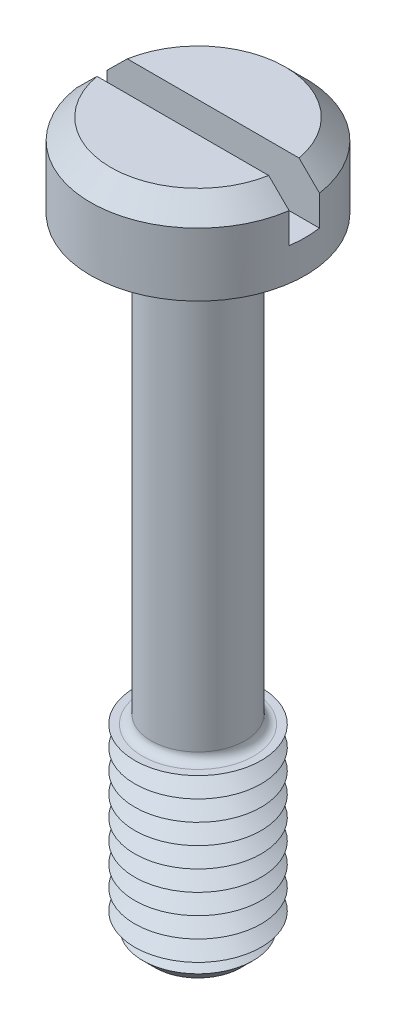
ISO-10303-21;
HEADER;
FILE_DESCRIPTION(('STEP AP214'),'2;1');
FILE_NAME('part.step','',(''),(''),'','','');
FILE_SCHEMA(('AUTOMOTIVE_DESIGN { 1 0 10303 214 1 1 1 1 }'));
ENDSEC;
DATA;
#1=APPLICATION_CONTEXT('core data for automotive mechanical design processes');
#2=APPLICATION_PROTOCOL_DEFINITION('international standard','automotive_design',2000,#1);
#3=PRODUCT_CONTEXT('',#1,'mechanical');
#4=PRODUCT('Part','Part','',(#3));
#5=PRODUCT_RELATED_PRODUCT_CATEGORY('part','',(#4));
#6=PRODUCT_DEFINITION_FORMATION('','',#4);
#7=PRODUCT_DEFINITION_CONTEXT('part definition',#1,'design');
#8=PRODUCT_DEFINITION('design','',#6,#7);
#9=PRODUCT_DEFINITION_SHAPE('','',#8);
#10=(LENGTH_UNIT() NAMED_UNIT(*) SI_UNIT(.MILLI.,.METRE.));
#11=(NAMED_UNIT(*) PLANE_ANGLE_UNIT() SI_UNIT($,.RADIAN.));
#12=(NAMED_UNIT(*) SI_UNIT($,.STERADIAN.) SOLID_ANGLE_UNIT());
#13=UNCERTAINTY_MEASURE_WITH_UNIT(LENGTH_MEASURE(1.E-05),#10,'distance_accuracy_value','');
#14=(GEOMETRIC_REPRESENTATION_CONTEXT(3) GLOBAL_UNCERTAINTY_ASSIGNED_CONTEXT((#13)) GLOBAL_UNIT_ASSIGNED_CONTEXT((#10,
#11,#12)) REPRESENTATION_CONTEXT('',''));
#15=CARTESIAN_POINT('',(0.,0.,0.));
#16=DIRECTION('',(0.,0.,1.));
#17=DIRECTION('',(1.,0.,0.));
#18=AXIS2_PLACEMENT_3D('',#15,#16,#17);
#19=CARTESIAN_POINT('',(0.,3.3,0.));
#20=DIRECTION('',(0.,1.,0.));
#21=DIRECTION('',(0.,0.,1.));
#22=AXIS2_PLACEMENT_3D('',#19,#20,#21);
#23=PLANE('',#22);
#24=DIRECTION('',(-1.,0.,0.));
#25=VECTOR('',#24,1.);
#26=CARTESIAN_POINT('',(4.25,3.3,-0.6));
#27=LINE('',#26,#25);
#28=CARTESIAN_POINT('',(3.39742549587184,3.3,-0.6));
#29=VERTEX_POINT('',#28);
#30=CARTESIAN_POINT('',(-3.39742549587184,3.3,-0.6));
#31=VERTEX_POINT('',#30);
#32=EDGE_CURVE('E110',#29,#31,#27,.T.);
#33=ORIENTED_EDGE('',*,*,#32,.F.);
#34=CARTESIAN_POINT('',(0.,3.3,0.));
#35=DIRECTION('',(0.,1.,0.));
#36=DIRECTION('',(0.,0.,1.));
#37=AXIS2_PLACEMENT_3D('',#34,#35,#36);
#38=CIRCLE('',#37,3.45000000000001);
#39=EDGE_CURVE('E113',#29,#31,#38,.T.);
#40=ORIENTED_EDGE('',*,*,#39,.T.);
#41=EDGE_LOOP('',(#33,#40));
#42=FACE_BOUND('',#41,.T.);
#43=ADVANCED_FACE('F39',(#42),#23,.T.);
#44=CARTESIAN_POINT('',(0.,3.3,0.));
#45=DIRECTION('',(0.,-1.,0.));
#46=DIRECTION('',(0.,0.,-1.));
#47=AXIS2_PLACEMENT_3D('',#44,#45,#46);
#48=CONICAL_SURFACE('',#47,3.45000000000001,0.785398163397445);
#49=CARTESIAN_POINT('',(9.35351408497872,-2.62273843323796,-0.6));
#50=CARTESIAN_POINT('',(9.03263557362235,-2.30252317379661,-0.6));
#51=CARTESIAN_POINT('',(8.71172811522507,-1.98233690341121,-0.6));
#52=CARTESIAN_POINT('',(8.06981262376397,-1.34205341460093,-0.6));
#53=CARTESIAN_POINT('',(7.74880458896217,-1.02195619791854,-0.6));
#54=CARTESIAN_POINT('',(7.10652460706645,-0.381761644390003,-0.6));
#55=CARTESIAN_POINT('',(6.7852526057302,-0.0616643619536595,-0.6));
#56=CARTESIAN_POINT('',(6.14251393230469,0.578323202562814,-0.6));
#57=CARTESIAN_POINT('',(5.82104726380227,0.898213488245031,-0.6));
#58=CARTESIAN_POINT('',(5.1719620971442,1.54347500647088,-0.6));
#59=CARTESIAN_POINT('',(4.84433778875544,1.86884039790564,-0.6));
#60=CARTESIAN_POINT('',(4.35244442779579,2.35644593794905,-0.6));
#61=CARTESIAN_POINT('',(4.18839924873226,2.51891187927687,-0.6));
#62=CARTESIAN_POINT('',(3.86009606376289,2.84362679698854,-0.6));
#63=CARTESIAN_POINT('',(3.69583805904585,3.00587577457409,-0.6));
#64=CARTESIAN_POINT('',(3.36705354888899,3.33001661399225,-0.6));
#65=CARTESIAN_POINT('',(3.20252712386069,3.49190855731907,-0.6));
#66=CARTESIAN_POINT('',(2.87298689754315,3.81520272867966,-0.6));
#67=CARTESIAN_POINT('',(2.70797308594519,3.97660494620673,-0.6));
#68=CARTESIAN_POINT('',(2.37716903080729,4.29858210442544,-0.6));
#69=CARTESIAN_POINT('',(2.21137886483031,4.45915712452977,-0.6));
#70=CARTESIAN_POINT('',(1.96157219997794,4.69884609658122,-0.6));
#71=CARTESIAN_POINT('',(1.87811785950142,4.77854546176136,-0.6));
#72=CARTESIAN_POINT('',(1.71066064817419,4.93736532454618,-0.6));
#73=CARTESIAN_POINT('',(1.62665778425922,5.01648582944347,-0.6));
#74=CARTESIAN_POINT('',(1.49655488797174,5.13773269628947,-0.6));
#75=CARTESIAN_POINT('',(1.45074972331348,5.18017521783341,-0.6));
#76=CARTESIAN_POINT('',(1.35882119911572,5.26471614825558,-0.6));
#77=CARTESIAN_POINT('',(1.31269783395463,5.30681455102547,-0.6));
#78=CARTESIAN_POINT('',(1.22008852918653,5.39050695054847,-0.6));
#79=CARTESIAN_POINT('',(1.17360305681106,5.43210146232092,-0.6));
#80=CARTESIAN_POINT('',(1.08007401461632,5.51465347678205,-0.6));
#81=CARTESIAN_POINT('',(1.03303046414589,5.55561100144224,-0.6));
#82=CARTESIAN_POINT('',(0.919047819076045,5.65299331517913,-0.6));
#83=CARTESIAN_POINT('',(0.85173842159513,5.70899242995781,-0.6));
#84=CARTESIAN_POINT('',(0.748806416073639,5.79068526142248,-0.6));
#85=CARTESIAN_POINT('',(0.714125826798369,5.81756213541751,-0.6));
#86=CARTESIAN_POINT('',(0.643915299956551,5.87018079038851,-0.6));
#87=CARTESIAN_POINT('',(0.608385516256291,5.89592277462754,-0.6));
#88=CARTESIAN_POINT('',(0.545162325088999,5.93955652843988,-0.6));
#89=CARTESIAN_POINT('',(0.517718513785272,5.95780799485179,-0.6));
#90=CARTESIAN_POINT('',(0.462025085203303,5.9930317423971,-0.6));
#91=CARTESIAN_POINT('',(0.43377569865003,6.01000438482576,-0.6));
#92=CARTESIAN_POINT('',(0.376341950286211,6.04213837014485,-0.6));
#93=CARTESIAN_POINT('',(0.347160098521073,6.05730412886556,-0.6));
#94=CARTESIAN_POINT('',(0.287642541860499,6.08513394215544,-0.6));
#95=CARTESIAN_POINT('',(0.257308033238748,6.09780051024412,-0.6));
#96=CARTESIAN_POINT('',(0.190863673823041,6.12124627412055,-0.6));
#97=CARTESIAN_POINT('',(0.154554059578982,6.13148571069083,-0.6));
#98=CARTESIAN_POINT('',(0.0807909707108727,6.14565404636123,-0.6));
#99=CARTESIAN_POINT('',(0.0433423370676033,6.14960664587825,-0.6));
#100=CARTESIAN_POINT('',(-0.0317987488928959,6.15033783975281,-0.6));
#101=CARTESIAN_POINT('',(-0.0694915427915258,6.14708428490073,-0.6));
#102=CARTESIAN_POINT('',(-0.143790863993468,6.13410921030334,-0.6));
#103=CARTESIAN_POINT('',(-0.180393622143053,6.12436747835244,-0.6));
#104=CARTESIAN_POINT('',(-0.254098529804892,6.09939647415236,-0.6));
#105=CARTESIAN_POINT('',(-0.291094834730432,6.08386859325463,-0.6));
#106=CARTESIAN_POINT('',(-0.36340802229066,6.04924663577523,-0.6));
#107=CARTESIAN_POINT('',(-0.398721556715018,6.03014579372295,-0.6));
#108=CARTESIAN_POINT('',(-0.468234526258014,5.98944452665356,-0.6));
#109=CARTESIAN_POINT('',(-0.502422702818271,5.96782521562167,-0.6));
#110=CARTESIAN_POINT('',(-0.569689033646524,5.9230061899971,-0.6));
#111=CARTESIAN_POINT('',(-0.602768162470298,5.89980792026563,-0.6));
#112=CARTESIAN_POINT('',(-0.671148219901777,5.85008963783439,-0.6));
#113=CARTESIAN_POINT('',(-0.706369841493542,5.82346130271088,-0.6));
#114=CARTESIAN_POINT('',(-0.776087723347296,5.76926828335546,-0.6));
#115=CARTESIAN_POINT('',(-0.810583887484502,5.74170347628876,-0.6));
#116=CARTESIAN_POINT('',(-0.913286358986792,5.65798278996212,-0.6));
#117=CARTESIAN_POINT('',(-0.980673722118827,5.60082541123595,-0.6));
#118=CARTESIAN_POINT('',(-1.11424616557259,5.48490670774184,-0.6));
#119=CARTESIAN_POINT('',(-1.18042891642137,5.42614273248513,-0.6));
#120=CARTESIAN_POINT('',(-1.31191262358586,5.30767463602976,-0.6));
#121=CARTESIAN_POINT('',(-1.37721382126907,5.24797078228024,-0.6));
#122=CARTESIAN_POINT('',(-1.50701089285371,5.12812906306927,-0.6));
#123=CARTESIAN_POINT('',(-1.57150872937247,5.06799331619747,-0.6));
#124=CARTESIAN_POINT('',(-1.70009132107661,4.94727328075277,-0.6));
#125=CARTESIAN_POINT('',(-1.76417604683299,4.88668896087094,-0.6));
#126=CARTESIAN_POINT('',(-1.95584105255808,4.70458824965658,-0.6));
#127=CARTESIAN_POINT('',(-2.08296922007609,4.5825964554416,-0.6));
#128=CARTESIAN_POINT('',(-2.33599178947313,4.33840625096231,-0.6));
#129=CARTESIAN_POINT('',(-2.46188913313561,4.21621087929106,-0.6));
#130=CARTESIAN_POINT('',(-2.71323511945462,3.97135925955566,-0.6));
#131=CARTESIAN_POINT('',(-2.83868376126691,3.84870301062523,-0.6));
#132=CARTESIAN_POINT('',(-3.21459106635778,3.48027743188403,-0.6));
#133=CARTESIAN_POINT('',(-3.4646062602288,3.23405597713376,-0.6));
#134=CARTESIAN_POINT('',(-3.96413793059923,2.74090313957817,-0.6));
#135=CARTESIAN_POINT('',(-4.21365415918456,2.49397150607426,-0.6));
#136=CARTESIAN_POINT('',(-4.71232475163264,1.99974737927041,-0.6));
#137=CARTESIAN_POINT('',(-4.96147911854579,1.75245488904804,-0.6));
#138=CARTESIAN_POINT('',(-5.45958725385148,1.2576154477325,-0.6));
#139=CARTESIAN_POINT('',(-5.70854099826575,1.01006847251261,-0.6));
#140=CARTESIAN_POINT('',(-6.20629498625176,0.514819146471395,-0.6));
#141=CARTESIAN_POINT('',(-6.45509522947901,0.267116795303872,-0.6));
#142=CARTESIAN_POINT('',(-7.20128563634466,-0.476100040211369,-0.6));
#143=CARTESIAN_POINT('',(-7.69851620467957,-0.971774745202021,-0.6));
#144=CARTESIAN_POINT('',(-8.38865115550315,-1.66007026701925,-0.6));
#145=CARTESIAN_POINT('',(-8.58165346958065,-1.85259293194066,-0.6));
#146=CARTESIAN_POINT('',(-8.87112736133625,-2.14139225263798,-0.6));
#147=CARTESIAN_POINT('',(-8.96761014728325,-2.23765767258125,-0.6));
#148=CARTESIAN_POINT('',(-9.16056764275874,-2.4301938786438,-0.6));
#149=CARTESIAN_POINT('',(-9.25704235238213,-2.52646466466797,-0.6));
#150=CARTESIAN_POINT('',(-9.35351408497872,-2.62273843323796,-0.6));
#151=B_SPLINE_CURVE_WITH_KNOTS('',3,(#49,#50,#51,#52,#53,#54,#55,#56,#57,#58,#59,#60,#61,#62,
#63,#64,#65,#66,#67,#68,#69,#70,#71,#72,#73,#74,#75,#76,#77,#78,#79,#80,#81,#82,#83,#84,#85,#86,
#87,#88,#89,#90,#91,#92,#93,#94,#95,#96,#97,#98,#99,#100,#101,#102,#103,#104,#105,#106,#107,
#108,#109,#110,#111,#112,#113,#114,#115,#116,#117,#118,#119,#120,#121,#122,#123,#124,#125,#126,
#127,#128,#129,#130,#131,#132,#133,#134,#135,#136,#137,#138,#139,#140,#141,#142,#143,#144,#145,
#146,#147,#148,#149,#150),.UNSPECIFIED.,.F.,.F.,(4,2,2,2,2,2,2,2,2,2,2,2,2,2,2,2,2,2,2,2,2,2,2,
2,2,2,2,2,2,2,2,2,2,2,2,2,2,2,2,2,2,2,2,2,2,2,2,2,2,2,4),(0.,1.35996600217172,2.71995696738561,
4.08050889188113,5.44103646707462,6.82624457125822,7.51888721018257,8.2115259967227,
8.90398568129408,9.59646011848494,10.288866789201,10.635058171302,10.9812451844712,
11.1685812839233,11.3559207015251,11.5430489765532,11.7301707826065,11.9927784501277,
12.1243921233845,12.2559821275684,12.3548333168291,12.4536564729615,12.5522329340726,
12.6507097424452,12.763461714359,12.8757876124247,12.9886156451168,13.101796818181,
13.2218851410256,13.3422031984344,13.4634899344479,13.584667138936,13.7171086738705,
13.8495676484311,14.1146090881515,14.3801178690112,14.6455524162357,14.910099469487,
15.17466516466,15.703234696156,16.2295761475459,16.7559185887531,17.8086237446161,
18.8617626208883,19.9148925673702,20.9681337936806,22.0213773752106,24.1276499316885,
24.9454725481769,25.354353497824,25.7632286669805),.UNSPECIFIED.);
#152=CARTESIAN_POINT('',(4.20743389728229,2.5,-0.6));
#153=VERTEX_POINT('',#152);
#154=EDGE_CURVE('E267',#153,#29,#151,.T.);
#155=ORIENTED_EDGE('',*,*,#154,.F.);
#156=CARTESIAN_POINT('',(0.,2.5,0.));
#157=DIRECTION('',(0.,1.,0.));
#158=DIRECTION('',(0.,0.,1.));
#159=AXIS2_PLACEMENT_3D('',#156,#157,#158);
#160=CIRCLE('',#159,4.25);
#161=CARTESIAN_POINT('',(-4.20743389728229,2.5,-0.6));
#162=VERTEX_POINT('',#161);
#163=EDGE_CURVE('E127',#162,#153,#160,.F.);
#164=ORIENTED_EDGE('',*,*,#163,.F.);
#165=EDGE_CURVE('E102',#31,#162,#151,.T.);
#166=ORIENTED_EDGE('',*,*,#165,.F.);
#167=ORIENTED_EDGE('',*,*,#39,.F.);
#168=EDGE_LOOP('',(#155,#164,#166,#167));
#169=FACE_BOUND('',#168,.T.);
#170=ADVANCED_FACE('F229',(#169),#48,.T.);
#171=CARTESIAN_POINT('',(0.,-25.,0.));
#172=DIRECTION('',(0.,1.,0.));
#173=DIRECTION('',(0.,0.,1.));
#174=AXIS2_PLACEMENT_3D('',#171,#172,#173);
#175=CYLINDRICAL_SURFACE('',#174,1.85);
#176=CARTESIAN_POINT('',(0.,-17.15,0.));
#177=DIRECTION('',(0.,-1.,0.));
#178=DIRECTION('',(0.,0.,-1.));
#179=AXIS2_PLACEMENT_3D('',#176,#177,#178);
#180=CIRCLE('',#179,1.85);
#181=CARTESIAN_POINT('',(0.,-17.15,-1.85));
#182=VERTEX_POINT('',#181);
#183=EDGE_CURVE('E122',#182,#182,#180,.F.);
#184=ORIENTED_EDGE('',*,*,#183,.T.);
#185=EDGE_LOOP('',(#184));
#186=FACE_BOUND('',#185,.T.);
#187=CARTESIAN_POINT('',(0.,-0.35,0.));
#188=DIRECTION('',(0.,1.,0.));
#189=DIRECTION('',(0.,0.,1.));
#190=AXIS2_PLACEMENT_3D('',#187,#188,#189);
#191=CIRCLE('',#190,1.85);
#192=CARTESIAN_POINT('',(0.,-0.35,1.85));
#193=VERTEX_POINT('',#192);
#194=EDGE_CURVE('E382',#193,#193,#191,.F.);
#195=ORIENTED_EDGE('',*,*,#194,.T.);
#196=EDGE_LOOP('',(#195));
#197=FACE_BOUND('',#196,.T.);
#198=ADVANCED_FACE('F225',(#186,#197),#175,.T.);
#199=CARTESIAN_POINT('',(0.,3.3,0.));
#200=DIRECTION('',(0.,-1.,0.));
#201=DIRECTION('',(0.,0.,-1.));
#202=AXIS2_PLACEMENT_3D('',#199,#200,#201);
#203=CYLINDRICAL_SURFACE('',#202,4.25);
#204=ORIENTED_EDGE('',*,*,#163,.T.);
#205=DIRECTION('',(0.,-1.,0.));
#206=VECTOR('',#205,1.);
#207=CARTESIAN_POINT('',(4.20743389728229,3.3,-0.6));
#208=LINE('',#207,#206);
#209=CARTESIAN_POINT('',(4.20743389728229,1.3,-0.6));
#210=VERTEX_POINT('',#209);
#211=EDGE_CURVE('E64',#153,#210,#208,.T.);
#212=ORIENTED_EDGE('',*,*,#211,.T.);
#213=CARTESIAN_POINT('',(0.,1.3,0.));
#214=DIRECTION('',(0.,1.,0.));
#215=DIRECTION('',(0.,0.,1.));
#216=AXIS2_PLACEMENT_3D('',#213,#214,#215);
#217=CIRCLE('',#216,4.25);
#218=CARTESIAN_POINT('',(4.20743389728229,1.3,0.6));
#219=VERTEX_POINT('',#218);
#220=EDGE_CURVE('E11',#219,#210,#217,.T.);
#221=ORIENTED_EDGE('',*,*,#220,.F.);
#222=DIRECTION('',(0.,-1.,0.));
#223=VECTOR('',#222,1.);
#224=CARTESIAN_POINT('',(4.20743389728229,3.3,0.6));
#225=LINE('',#224,#223);
#226=CARTESIAN_POINT('',(4.20743389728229,2.5,0.6));
#227=VERTEX_POINT('',#226);
#228=EDGE_CURVE('E282',#219,#227,#225,.F.);
#229=ORIENTED_EDGE('',*,*,#228,.T.);
#230=CARTESIAN_POINT('',(-4.20743389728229,2.5,0.6));
#231=VERTEX_POINT('',#230);
#232=EDGE_CURVE('E119',#227,#231,#160,.F.);
#233=ORIENTED_EDGE('',*,*,#232,.T.);
#234=DIRECTION('',(0.,-1.,0.));
#235=VECTOR('',#234,1.);
#236=CARTESIAN_POINT('',(-4.20743389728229,3.3,0.6));
#237=LINE('',#236,#235);
#238=CARTESIAN_POINT('',(-4.20743389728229,1.3,0.6));
#239=VERTEX_POINT('',#238);
#240=EDGE_CURVE('E96',#231,#239,#237,.T.);
#241=ORIENTED_EDGE('',*,*,#240,.T.);
#242=CARTESIAN_POINT('',(-4.20743389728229,1.3,-0.6));
#243=VERTEX_POINT('',#242);
#244=EDGE_CURVE('E44',#243,#239,#217,.T.);
#245=ORIENTED_EDGE('',*,*,#244,.F.);
#246=DIRECTION('',(0.,-1.,0.));
#247=VECTOR('',#246,1.);
#248=CARTESIAN_POINT('',(-4.20743389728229,3.3,-0.6));
#249=LINE('',#248,#247);
#250=EDGE_CURVE('E287',#243,#162,#249,.F.);
#251=ORIENTED_EDGE('',*,*,#250,.T.);
#252=EDGE_LOOP('',(#204,#212,#221,#229,#233,#241,#245,#251));
#253=FACE_BOUND('',#252,.T.);
#254=CARTESIAN_POINT('',(0.,0.,0.));
#255=DIRECTION('',(0.,1.,0.));
#256=DIRECTION('',(0.,0.,1.));
#257=AXIS2_PLACEMENT_3D('',#254,#255,#256);
#258=CIRCLE('',#257,4.25);
#259=CARTESIAN_POINT('',(0.,0.,4.25));
#260=VERTEX_POINT('',#259);
#261=EDGE_CURVE('E368',#260,#260,#258,.T.);
#262=ORIENTED_EDGE('',*,*,#261,.T.);
#263=EDGE_LOOP('',(#262));
#264=FACE_BOUND('',#263,.T.);
#265=ADVANCED_FACE('F228',(#253,#264),#203,.T.);
#266=DIRECTION('',(1.,0.,0.));
#267=VECTOR('',#266,1.);
#268=CARTESIAN_POINT('',(4.25,3.3,0.6));
#269=LINE('',#268,#267);
#270=CARTESIAN_POINT('',(-3.39742549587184,3.3,0.6));
#271=VERTEX_POINT('',#270);
#272=CARTESIAN_POINT('',(3.39742549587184,3.3,0.6));
#273=VERTEX_POINT('',#272);
#274=EDGE_CURVE('E56',#271,#273,#269,.T.);
#275=ORIENTED_EDGE('',*,*,#274,.F.);
#276=EDGE_CURVE('E108',#271,#273,#38,.T.);
#277=ORIENTED_EDGE('',*,*,#276,.T.);
#278=EDGE_LOOP('',(#275,#277));
#279=FACE_BOUND('',#278,.T.);
#280=ADVANCED_FACE('F107',(#279),#23,.T.);
#281=CARTESIAN_POINT('',(0.,0.,0.));
#282=DIRECTION('',(0.,1.,0.));
#283=DIRECTION('',(0.,0.,1.));
#284=AXIS2_PLACEMENT_3D('',#281,#282,#283);
#285=PLANE('',#284);
#286=CARTESIAN_POINT('',(0.,0.,0.));
#287=DIRECTION('',(0.,1.,0.));
#288=DIRECTION('',(0.,0.,1.));
#289=AXIS2_PLACEMENT_3D('',#286,#287,#288);
#290=CIRCLE('',#289,2.2);
#291=CARTESIAN_POINT('',(0.,0.,2.2));
#292=VERTEX_POINT('',#291);
#293=EDGE_CURVE('E114',#292,#292,#290,.T.);
#294=ORIENTED_EDGE('',*,*,#293,.T.);
#295=EDGE_LOOP('',(#294));
#296=FACE_BOUND('',#295,.T.);
#297=ORIENTED_EDGE('',*,*,#261,.F.);
#298=EDGE_LOOP('',(#297));
#299=FACE_BOUND('',#298,.T.);
#300=ADVANCED_FACE('F219',(#296,#299),#285,.F.);
#301=CARTESIAN_POINT('',(0.,-17.5,0.));
#302=DIRECTION('',(0.,-1.,0.));
#303=DIRECTION('',(0.,0.,-1.));
#304=AXIS2_PLACEMENT_3D('',#301,#302,#303);
#305=PLANE('',#304);
#306=CARTESIAN_POINT('',(0.,-17.5,0.));
#307=DIRECTION('',(0.,-1.,0.));
#308=DIRECTION('',(0.,0.,-1.));
#309=AXIS2_PLACEMENT_3D('',#306,#307,#308);
#310=CIRCLE('',#309,2.2);
#311=CARTESIAN_POINT('',(0.,-17.5,-2.2));
#312=VERTEX_POINT('',#311);
#313=EDGE_CURVE('E375',#312,#312,#310,.T.);
#314=ORIENTED_EDGE('',*,*,#313,.T.);
#315=EDGE_LOOP('',(#314));
#316=FACE_BOUND('',#315,.T.);
#317=CARTESIAN_POINT('',(0.,-17.5,0.));
#318=DIRECTION('',(0.,1.,0.));
#319=DIRECTION('',(0.,0.,1.));
#320=AXIS2_PLACEMENT_3D('',#317,#318,#319);
#321=CIRCLE('',#320,2.5);
#322=CARTESIAN_POINT('',(0.,-17.5,2.5));
#323=VERTEX_POINT('',#322);
#324=EDGE_CURVE('E364',#323,#323,#321,.T.);
#325=ORIENTED_EDGE('',*,*,#324,.T.);
#326=EDGE_LOOP('',(#325));
#327=FACE_BOUND('',#326,.T.);
#328=ADVANCED_FACE('F215',(#316,#327),#305,.F.);
#329=CARTESIAN_POINT('',(0.,-17.9,0.));
#330=DIRECTION('',(0.,1.,0.));
#331=DIRECTION('',(0.,0.,1.));
#332=AXIS2_PLACEMENT_3D('',#329,#330,#331);
#333=CONICAL_SURFACE('',#332,1.80717967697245,1.0471975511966);
#334=ORIENTED_EDGE('',*,*,#324,.F.);
#335=EDGE_LOOP('',(#334));
#336=FACE_BOUND('',#335,.T.);
#337=CARTESIAN_POINT('',(0.,-17.9,0.));
#338=DIRECTION('',(0.,1.,0.));
#339=DIRECTION('',(0.,0.,1.));
#340=AXIS2_PLACEMENT_3D('',#337,#338,#339);
#341=CIRCLE('',#340,1.80717967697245);
#342=CARTESIAN_POINT('',(0.,-17.9,1.80717967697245));
#343=VERTEX_POINT('',#342);
#344=EDGE_CURVE('E360',#343,#343,#341,.T.);
#345=ORIENTED_EDGE('',*,*,#344,.T.);
#346=EDGE_LOOP('',(#345));
#347=FACE_BOUND('',#346,.T.);
#348=ADVANCED_FACE('F211',(#336,#347),#333,.T.);
#349=CARTESIAN_POINT('',(0.,-18.3,0.));
#350=DIRECTION('',(0.,-1.,0.));
#351=DIRECTION('',(0.,0.,-1.));
#352=AXIS2_PLACEMENT_3D('',#349,#350,#351);
#353=CONICAL_SURFACE('',#352,2.5,1.0471975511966);
#354=ORIENTED_EDGE('',*,*,#344,.F.);
#355=EDGE_LOOP('',(#354));
#356=FACE_BOUND('',#355,.T.);
#357=CARTESIAN_POINT('',(0.,-18.3,0.));
#358=DIRECTION('',(0.,1.,0.));
#359=DIRECTION('',(0.,0.,1.));
#360=AXIS2_PLACEMENT_3D('',#357,#358,#359);
#361=CIRCLE('',#360,2.5);
#362=CARTESIAN_POINT('',(0.,-18.3,2.5));
#363=VERTEX_POINT('',#362);
#364=EDGE_CURVE('E356',#363,#363,#361,.T.);
#365=ORIENTED_EDGE('',*,*,#364,.T.);
#366=EDGE_LOOP('',(#365));
#367=FACE_BOUND('',#366,.T.);
#368=ADVANCED_FACE('F207',(#356,#367),#353,.T.);
#369=CARTESIAN_POINT('',(0.,-18.7,0.));
#370=DIRECTION('',(0.,1.,0.));
#371=DIRECTION('',(0.,0.,1.));
#372=AXIS2_PLACEMENT_3D('',#369,#370,#371);
#373=CONICAL_SURFACE('',#372,1.80717967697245,1.0471975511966);
#374=ORIENTED_EDGE('',*,*,#364,.F.);
#375=EDGE_LOOP('',(#374));
#376=FACE_BOUND('',#375,.T.);
#377=CARTESIAN_POINT('',(0.,-18.7,0.));
#378=DIRECTION('',(0.,1.,0.));
#379=DIRECTION('',(0.,0.,1.));
#380=AXIS2_PLACEMENT_3D('',#377,#378,#379);
#381=CIRCLE('',#380,1.80717967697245);
#382=CARTESIAN_POINT('',(0.,-18.7,1.80717967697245));
#383=VERTEX_POINT('',#382);
#384=EDGE_CURVE('E352',#383,#383,#381,.T.);
#385=ORIENTED_EDGE('',*,*,#384,.T.);
#386=EDGE_LOOP('',(#385));
#387=FACE_BOUND('',#386,.T.);
#388=ADVANCED_FACE('F203',(#376,#387),#373,.T.);
#389=CARTESIAN_POINT('',(0.,-19.1,0.));
#390=DIRECTION('',(0.,-1.,0.));
#391=DIRECTION('',(0.,0.,-1.));
#392=AXIS2_PLACEMENT_3D('',#389,#390,#391);
#393=CONICAL_SURFACE('',#392,2.5,1.0471975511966);
#394=ORIENTED_EDGE('',*,*,#384,.F.);
#395=EDGE_LOOP('',(#394));
#396=FACE_BOUND('',#395,.T.);
#397=CARTESIAN_POINT('',(0.,-19.1,0.));
#398=DIRECTION('',(0.,1.,0.));
#399=DIRECTION('',(0.,0.,1.));
#400=AXIS2_PLACEMENT_3D('',#397,#398,#399);
#401=CIRCLE('',#400,2.5);
#402=CARTESIAN_POINT('',(0.,-19.1,2.5));
#403=VERTEX_POINT('',#402);
#404=EDGE_CURVE('E348',#403,#403,#401,.T.);
#405=ORIENTED_EDGE('',*,*,#404,.T.);
#406=EDGE_LOOP('',(#405));
#407=FACE_BOUND('',#406,.T.);
#408=ADVANCED_FACE('F199',(#396,#407),#393,.T.);
#409=CARTESIAN_POINT('',(0.,-19.5,0.));
#410=DIRECTION('',(0.,1.,0.));
#411=DIRECTION('',(0.,0.,1.));
#412=AXIS2_PLACEMENT_3D('',#409,#410,#411);
#413=CONICAL_SURFACE('',#412,1.80717967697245,1.0471975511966);
#414=ORIENTED_EDGE('',*,*,#404,.F.);
#415=EDGE_LOOP('',(#414));
#416=FACE_BOUND('',#415,.T.);
#417=CARTESIAN_POINT('',(0.,-19.5,0.));
#418=DIRECTION('',(0.,1.,0.));
#419=DIRECTION('',(0.,0.,1.));
#420=AXIS2_PLACEMENT_3D('',#417,#418,#419);
#421=CIRCLE('',#420,1.80717967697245);
#422=CARTESIAN_POINT('',(0.,-19.5,1.80717967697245));
#423=VERTEX_POINT('',#422);
#424=EDGE_CURVE('E344',#423,#423,#421,.T.);
#425=ORIENTED_EDGE('',*,*,#424,.T.);
#426=EDGE_LOOP('',(#425));
#427=FACE_BOUND('',#426,.T.);
#428=ADVANCED_FACE('F195',(#416,#427),#413,.T.);
#429=CARTESIAN_POINT('',(0.,-19.9,0.));
#430=DIRECTION('',(0.,-1.,0.));
#431=DIRECTION('',(0.,0.,-1.));
#432=AXIS2_PLACEMENT_3D('',#429,#430,#431);
#433=CONICAL_SURFACE('',#432,2.5,1.0471975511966);
#434=ORIENTED_EDGE('',*,*,#424,.F.);
#435=EDGE_LOOP('',(#434));
#436=FACE_BOUND('',#435,.T.);
#437=CARTESIAN_POINT('',(0.,-19.9,0.));
#438=DIRECTION('',(0.,1.,0.));
#439=DIRECTION('',(0.,0.,1.));
#440=AXIS2_PLACEMENT_3D('',#437,#438,#439);
#441=CIRCLE('',#440,2.5);
#442=CARTESIAN_POINT('',(0.,-19.9,2.5));
#443=VERTEX_POINT('',#442);
#444=EDGE_CURVE('E340',#443,#443,#441,.T.);
#445=ORIENTED_EDGE('',*,*,#444,.T.);
#446=EDGE_LOOP('',(#445));
#447=FACE_BOUND('',#446,.T.);
#448=ADVANCED_FACE('F191',(#436,#447),#433,.T.);
#449=CARTESIAN_POINT('',(0.,-20.3,0.));
#450=DIRECTION('',(0.,1.,0.));
#451=DIRECTION('',(0.,0.,1.));
#452=AXIS2_PLACEMENT_3D('',#449,#450,#451);
#453=CONICAL_SURFACE('',#452,1.80717967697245,1.0471975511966);
#454=ORIENTED_EDGE('',*,*,#444,.F.);
#455=EDGE_LOOP('',(#454));
#456=FACE_BOUND('',#455,.T.);
#457=CARTESIAN_POINT('',(0.,-20.3,0.));
#458=DIRECTION('',(0.,1.,0.));
#459=DIRECTION('',(0.,0.,1.));
#460=AXIS2_PLACEMENT_3D('',#457,#458,#459);
#461=CIRCLE('',#460,1.80717967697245);
#462=CARTESIAN_POINT('',(0.,-20.3,1.80717967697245));
#463=VERTEX_POINT('',#462);
#464=EDGE_CURVE('E336',#463,#463,#461,.T.);
#465=ORIENTED_EDGE('',*,*,#464,.T.);
#466=EDGE_LOOP('',(#465));
#467=FACE_BOUND('',#466,.T.);
#468=ADVANCED_FACE('F187',(#456,#467),#453,.T.);
#469=CARTESIAN_POINT('',(0.,-20.7,0.));
#470=DIRECTION('',(0.,-1.,0.));
#471=DIRECTION('',(0.,0.,-1.));
#472=AXIS2_PLACEMENT_3D('',#469,#470,#471);
#473=CONICAL_SURFACE('',#472,2.5,1.0471975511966);
#474=ORIENTED_EDGE('',*,*,#464,.F.);
#475=EDGE_LOOP('',(#474));
#476=FACE_BOUND('',#475,.T.);
#477=CARTESIAN_POINT('',(0.,-20.7,0.));
#478=DIRECTION('',(0.,1.,0.));
#479=DIRECTION('',(0.,0.,1.));
#480=AXIS2_PLACEMENT_3D('',#477,#478,#479);
#481=CIRCLE('',#480,2.5);
#482=CARTESIAN_POINT('',(0.,-20.7,2.5));
#483=VERTEX_POINT('',#482);
#484=EDGE_CURVE('E332',#483,#483,#481,.T.);
#485=ORIENTED_EDGE('',*,*,#484,.T.);
#486=EDGE_LOOP('',(#485));
#487=FACE_BOUND('',#486,.T.);
#488=ADVANCED_FACE('F183',(#476,#487),#473,.T.);
#489=CARTESIAN_POINT('',(0.,-21.1,0.));
#490=DIRECTION('',(0.,1.,0.));
#491=DIRECTION('',(0.,0.,1.));
#492=AXIS2_PLACEMENT_3D('',#489,#490,#491);
#493=CONICAL_SURFACE('',#492,1.80717967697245,1.0471975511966);
#494=ORIENTED_EDGE('',*,*,#484,.F.);
#495=EDGE_LOOP('',(#494));
#496=FACE_BOUND('',#495,.T.);
#497=CARTESIAN_POINT('',(0.,-21.1,0.));
#498=DIRECTION('',(0.,1.,0.));
#499=DIRECTION('',(0.,0.,1.));
#500=AXIS2_PLACEMENT_3D('',#497,#498,#499);
#501=CIRCLE('',#500,1.80717967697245);
#502=CARTESIAN_POINT('',(0.,-21.1,1.80717967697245));
#503=VERTEX_POINT('',#502);
#504=EDGE_CURVE('E328',#503,#503,#501,.T.);
#505=ORIENTED_EDGE('',*,*,#504,.T.);
#506=EDGE_LOOP('',(#505));
#507=FACE_BOUND('',#506,.T.);
#508=ADVANCED_FACE('F179',(#496,#507),#493,.T.);
#509=CARTESIAN_POINT('',(0.,-21.5,0.));
#510=DIRECTION('',(0.,-1.,0.));
#511=DIRECTION('',(0.,0.,-1.));
#512=AXIS2_PLACEMENT_3D('',#509,#510,#511);
#513=CONICAL_SURFACE('',#512,2.5,1.0471975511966);
#514=ORIENTED_EDGE('',*,*,#504,.F.);
#515=EDGE_LOOP('',(#514));
#516=FACE_BOUND('',#515,.T.);
#517=CARTESIAN_POINT('',(0.,-21.5,0.));
#518=DIRECTION('',(0.,1.,0.));
#519=DIRECTION('',(0.,0.,1.));
#520=AXIS2_PLACEMENT_3D('',#517,#518,#519);
#521=CIRCLE('',#520,2.5);
#522=CARTESIAN_POINT('',(0.,-21.5,2.5));
#523=VERTEX_POINT('',#522);
#524=EDGE_CURVE('E324',#523,#523,#521,.T.);
#525=ORIENTED_EDGE('',*,*,#524,.T.);
#526=EDGE_LOOP('',(#525));
#527=FACE_BOUND('',#526,.T.);
#528=ADVANCED_FACE('F175',(#516,#527),#513,.T.);
#529=CARTESIAN_POINT('',(0.,-21.9,0.));
#530=DIRECTION('',(0.,1.,0.));
#531=DIRECTION('',(0.,0.,1.));
#532=AXIS2_PLACEMENT_3D('',#529,#530,#531);
#533=CONICAL_SURFACE('',#532,1.80717967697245,1.0471975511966);
#534=ORIENTED_EDGE('',*,*,#524,.F.);
#535=EDGE_LOOP('',(#534));
#536=FACE_BOUND('',#535,.T.);
#537=CARTESIAN_POINT('',(0.,-21.9,0.));
#538=DIRECTION('',(0.,1.,0.));
#539=DIRECTION('',(0.,0.,1.));
#540=AXIS2_PLACEMENT_3D('',#537,#538,#539);
#541=CIRCLE('',#540,1.80717967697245);
#542=CARTESIAN_POINT('',(0.,-21.9,1.80717967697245));
#543=VERTEX_POINT('',#542);
#544=EDGE_CURVE('E321',#543,#543,#541,.T.);
#545=ORIENTED_EDGE('',*,*,#544,.T.);
#546=EDGE_LOOP('',(#545));
#547=FACE_BOUND('',#546,.T.);
#548=ADVANCED_FACE('F171',(#536,#547),#533,.T.);
#549=CARTESIAN_POINT('',(0.,-22.3,0.));
#550=DIRECTION('',(0.,-1.,0.));
#551=DIRECTION('',(0.,0.,-1.));
#552=AXIS2_PLACEMENT_3D('',#549,#550,#551);
#553=CONICAL_SURFACE('',#552,2.5,1.0471975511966);
#554=ORIENTED_EDGE('',*,*,#544,.F.);
#555=EDGE_LOOP('',(#554));
#556=FACE_BOUND('',#555,.T.);
#557=CARTESIAN_POINT('',(0.,-22.3,0.));
#558=DIRECTION('',(0.,1.,0.));
#559=DIRECTION('',(0.,0.,1.));
#560=AXIS2_PLACEMENT_3D('',#557,#558,#559);
#561=CIRCLE('',#560,2.5);
#562=CARTESIAN_POINT('',(0.,-22.3,2.5));
#563=VERTEX_POINT('',#562);
#564=EDGE_CURVE('E317',#563,#563,#561,.T.);
#565=ORIENTED_EDGE('',*,*,#564,.T.);
#566=EDGE_LOOP('',(#565));
#567=FACE_BOUND('',#566,.T.);
#568=ADVANCED_FACE('F167',(#556,#567),#553,.T.);
#569=CARTESIAN_POINT('',(0.,-22.7,0.));
#570=DIRECTION('',(0.,1.,0.));
#571=DIRECTION('',(0.,0.,1.));
#572=AXIS2_PLACEMENT_3D('',#569,#570,#571);
#573=CONICAL_SURFACE('',#572,1.80717967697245,1.0471975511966);
#574=ORIENTED_EDGE('',*,*,#564,.F.);
#575=EDGE_LOOP('',(#574));
#576=FACE_BOUND('',#575,.T.);
#577=CARTESIAN_POINT('',(0.,-22.7,0.));
#578=DIRECTION('',(0.,1.,0.));
#579=DIRECTION('',(0.,0.,1.));
#580=AXIS2_PLACEMENT_3D('',#577,#578,#579);
#581=CIRCLE('',#580,1.80717967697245);
#582=CARTESIAN_POINT('',(0.,-22.7,1.80717967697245));
#583=VERTEX_POINT('',#582);
#584=EDGE_CURVE('E313',#583,#583,#581,.T.);
#585=ORIENTED_EDGE('',*,*,#584,.T.);
#586=EDGE_LOOP('',(#585));
#587=FACE_BOUND('',#586,.T.);
#588=ADVANCED_FACE('F163',(#576,#587),#573,.T.);
#589=CARTESIAN_POINT('',(0.,-23.1,0.));
#590=DIRECTION('',(0.,-1.,0.));
#591=DIRECTION('',(0.,0.,-1.));
#592=AXIS2_PLACEMENT_3D('',#589,#590,#591);
#593=CONICAL_SURFACE('',#592,2.5,1.0471975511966);
#594=ORIENTED_EDGE('',*,*,#584,.F.);
#595=EDGE_LOOP('',(#594));
#596=FACE_BOUND('',#595,.T.);
#597=CARTESIAN_POINT('',(0.,-23.1,0.));
#598=DIRECTION('',(0.,1.,0.));
#599=DIRECTION('',(0.,0.,1.));
#600=AXIS2_PLACEMENT_3D('',#597,#598,#599);
#601=CIRCLE('',#600,2.5);
#602=CARTESIAN_POINT('',(0.,-23.1,2.5));
#603=VERTEX_POINT('',#602);
#604=EDGE_CURVE('E309',#603,#603,#601,.T.);
#605=ORIENTED_EDGE('',*,*,#604,.T.);
#606=EDGE_LOOP('',(#605));
#607=FACE_BOUND('',#606,.T.);
#608=ADVANCED_FACE('F159',(#596,#607),#593,.T.);
#609=CARTESIAN_POINT('',(0.,-23.5,0.));
#610=DIRECTION('',(0.,1.,0.));
#611=DIRECTION('',(0.,0.,1.));
#612=AXIS2_PLACEMENT_3D('',#609,#610,#611);
#613=CONICAL_SURFACE('',#612,1.80717967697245,1.0471975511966);
#614=ORIENTED_EDGE('',*,*,#604,.F.);
#615=EDGE_LOOP('',(#614));
#616=FACE_BOUND('',#615,.T.);
#617=CARTESIAN_POINT('',(0.,-23.5,0.));
#618=DIRECTION('',(0.,1.,0.));
#619=DIRECTION('',(0.,0.,1.));
#620=AXIS2_PLACEMENT_3D('',#617,#618,#619);
#621=CIRCLE('',#620,1.80717967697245);
#622=CARTESIAN_POINT('',(0.,-23.5,1.80717967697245));
#623=VERTEX_POINT('',#622);
#624=EDGE_CURVE('E306',#623,#623,#621,.T.);
#625=ORIENTED_EDGE('',*,*,#624,.T.);
#626=EDGE_LOOP('',(#625));
#627=FACE_BOUND('',#626,.T.);
#628=ADVANCED_FACE('F155',(#616,#627),#613,.T.);
#629=CARTESIAN_POINT('',(0.,-23.9,0.));
#630=DIRECTION('',(0.,-1.,0.));
#631=DIRECTION('',(0.,0.,-1.));
#632=AXIS2_PLACEMENT_3D('',#629,#630,#631);
#633=CONICAL_SURFACE('',#632,2.5,1.0471975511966);
#634=ORIENTED_EDGE('',*,*,#624,.F.);
#635=EDGE_LOOP('',(#634));
#636=FACE_BOUND('',#635,.T.);
#637=CARTESIAN_POINT('',(0.,-23.9,0.));
#638=DIRECTION('',(0.,1.,0.));
#639=DIRECTION('',(0.,0.,1.));
#640=AXIS2_PLACEMENT_3D('',#637,#638,#639);
#641=CIRCLE('',#640,2.5);
#642=CARTESIAN_POINT('',(0.,-23.9,2.5));
#643=VERTEX_POINT('',#642);
#644=EDGE_CURVE('E302',#643,#643,#641,.T.);
#645=ORIENTED_EDGE('',*,*,#644,.T.);
#646=EDGE_LOOP('',(#645));
#647=FACE_BOUND('',#646,.T.);
#648=ADVANCED_FACE('F151',(#636,#647),#633,.T.);
#649=CARTESIAN_POINT('',(0.,-24.3,0.));
#650=DIRECTION('',(0.,1.,0.));
#651=DIRECTION('',(0.,0.,1.));
#652=AXIS2_PLACEMENT_3D('',#649,#650,#651);
#653=CONICAL_SURFACE('',#652,1.80717967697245,1.0471975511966);
#654=ORIENTED_EDGE('',*,*,#644,.F.);
#655=EDGE_LOOP('',(#654));
#656=FACE_BOUND('',#655,.T.);
#657=CARTESIAN_POINT('',(0.,-24.3,0.));
#658=DIRECTION('',(0.,1.,0.));
#659=DIRECTION('',(0.,0.,1.));
#660=AXIS2_PLACEMENT_3D('',#657,#658,#659);
#661=CIRCLE('',#660,1.80717967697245);
#662=CARTESIAN_POINT('',(0.,-24.3,1.80717967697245));
#663=VERTEX_POINT('',#662);
#664=EDGE_CURVE('E298',#663,#663,#661,.T.);
#665=ORIENTED_EDGE('',*,*,#664,.T.);
#666=EDGE_LOOP('',(#665));
#667=FACE_BOUND('',#666,.T.);
#668=ADVANCED_FACE('F147',(#656,#667),#653,.T.);
#669=CARTESIAN_POINT('',(0.,-24.7,0.));
#670=DIRECTION('',(0.,-1.,0.));
#671=DIRECTION('',(0.,0.,-1.));
#672=AXIS2_PLACEMENT_3D('',#669,#670,#671);
#673=CONICAL_SURFACE('',#672,2.5,1.0471975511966);
#674=CARTESIAN_POINT('',(0.,-24.5169872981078,0.));
#675=DIRECTION('',(0.,-1.,0.));
#676=DIRECTION('',(0.,0.,-1.));
#677=AXIS2_PLACEMENT_3D('',#674,#675,#676);
#678=CIRCLE('',#677,2.18301270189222);
#679=CARTESIAN_POINT('',(0.,-24.5169872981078,-2.18301270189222));
#680=VERTEX_POINT('',#679);
#681=EDGE_CURVE('E305',#680,#680,#678,.F.);
#682=ORIENTED_EDGE('',*,*,#681,.T.);
#683=EDGE_LOOP('',(#682));
#684=FACE_BOUND('',#683,.T.);
#685=ORIENTED_EDGE('',*,*,#664,.F.);
#686=EDGE_LOOP('',(#685));
#687=FACE_BOUND('',#686,.T.);
#688=ADVANCED_FACE('F143',(#684,#687),#673,.T.);
#689=CARTESIAN_POINT('',(0.,-25.,0.));
#690=DIRECTION('',(0.,-1.,0.));
#691=DIRECTION('',(0.,0.,-1.));
#692=AXIS2_PLACEMENT_3D('',#689,#690,#691);
#693=PLANE('',#692);
#694=CARTESIAN_POINT('',(0.,-25.,0.));
#695=DIRECTION('',(0.,-1.,0.));
#696=DIRECTION('',(0.,0.,-1.));
#697=AXIS2_PLACEMENT_3D('',#694,#695,#696);
#698=CIRCLE('',#697,1.7);
#699=CARTESIAN_POINT('',(0.,-25.,-1.7));
#700=VERTEX_POINT('',#699);
#701=EDGE_CURVE('E372',#700,#700,#698,.T.);
#702=ORIENTED_EDGE('',*,*,#701,.T.);
#703=EDGE_LOOP('',(#702));
#704=FACE_BOUND('',#703,.T.);
#705=ADVANCED_FACE('F146',(#704),#693,.T.);
#706=CARTESIAN_POINT('',(0.,-25.,0.));
#707=DIRECTION('',(0.,1.,0.));
#708=DIRECTION('',(0.,0.,1.));
#709=AXIS2_PLACEMENT_3D('',#706,#707,#708);
#710=CONICAL_SURFACE('',#709,1.7,0.785398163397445);
#711=ORIENTED_EDGE('',*,*,#681,.F.);
#712=EDGE_LOOP('',(#711));
#713=FACE_BOUND('',#712,.T.);
#714=ORIENTED_EDGE('',*,*,#701,.F.);
#715=EDGE_LOOP('',(#714));
#716=FACE_BOUND('',#715,.T.);
#717=ADVANCED_FACE('F223',(#713,#716),#710,.T.);
#718=CARTESIAN_POINT('',(0.,-17.15,0.));
#719=DIRECTION('',(0.,-1.,0.));
#720=DIRECTION('',(0.,0.,-1.));
#721=AXIS2_PLACEMENT_3D('',#718,#719,#720);
#722=TOROIDAL_SURFACE('',#721,2.2,0.35);
#723=ORIENTED_EDGE('',*,*,#183,.F.);
#724=EDGE_LOOP('',(#723));
#725=FACE_BOUND('',#724,.T.);
#726=ORIENTED_EDGE('',*,*,#313,.F.);
#727=EDGE_LOOP('',(#726));
#728=FACE_BOUND('',#727,.T.);
#729=ADVANCED_FACE('F241',(#725,#728),#722,.F.);
#730=CARTESIAN_POINT('',(0.,-0.35,0.));
#731=DIRECTION('',(0.,1.,0.));
#732=DIRECTION('',(0.,0.,1.));
#733=AXIS2_PLACEMENT_3D('',#730,#731,#732);
#734=TOROIDAL_SURFACE('',#733,2.2,0.35);
#735=ORIENTED_EDGE('',*,*,#293,.F.);
#736=EDGE_LOOP('',(#735));
#737=FACE_BOUND('',#736,.T.);
#738=ORIENTED_EDGE('',*,*,#194,.F.);
#739=EDGE_LOOP('',(#738));
#740=FACE_BOUND('',#739,.T.);
#741=ADVANCED_FACE('F244',(#737,#740),#734,.F.);
#742=CARTESIAN_POINT('',(-9.35351408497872,-2.62273843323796,0.6));
#743=CARTESIAN_POINT('',(-9.03263557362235,-2.30252317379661,0.6));
#744=CARTESIAN_POINT('',(-8.71172811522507,-1.98233690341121,0.6));
#745=CARTESIAN_POINT('',(-8.06981262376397,-1.34205341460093,0.6));
#746=CARTESIAN_POINT('',(-7.74880458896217,-1.02195619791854,0.6));
#747=CARTESIAN_POINT('',(-7.10652460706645,-0.381761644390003,0.6));
#748=CARTESIAN_POINT('',(-6.7852526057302,-0.0616643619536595,0.6));
#749=CARTESIAN_POINT('',(-6.14251393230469,0.578323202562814,0.6));
#750=CARTESIAN_POINT('',(-5.82104726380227,0.898213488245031,0.6));
#751=CARTESIAN_POINT('',(-5.1719620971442,1.54347500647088,0.6));
#752=CARTESIAN_POINT('',(-4.84433778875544,1.86884039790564,0.6));
#753=CARTESIAN_POINT('',(-4.35244442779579,2.35644593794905,0.6));
#754=CARTESIAN_POINT('',(-4.18839924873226,2.51891187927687,0.6));
#755=CARTESIAN_POINT('',(-3.86009606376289,2.84362679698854,0.6));
#756=CARTESIAN_POINT('',(-3.69583805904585,3.00587577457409,0.6));
#757=CARTESIAN_POINT('',(-3.36705354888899,3.33001661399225,0.6));
#758=CARTESIAN_POINT('',(-3.20252712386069,3.49190855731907,0.6));
#759=CARTESIAN_POINT('',(-2.87298689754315,3.81520272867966,0.6));
#760=CARTESIAN_POINT('',(-2.70797308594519,3.97660494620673,0.6));
#761=CARTESIAN_POINT('',(-2.37716903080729,4.29858210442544,0.6));
#762=CARTESIAN_POINT('',(-2.21137886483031,4.45915712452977,0.6));
#763=CARTESIAN_POINT('',(-1.96157219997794,4.69884609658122,0.6));
#764=CARTESIAN_POINT('',(-1.87811785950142,4.77854546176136,0.6));
#765=CARTESIAN_POINT('',(-1.71066064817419,4.93736532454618,0.6));
#766=CARTESIAN_POINT('',(-1.62665778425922,5.01648582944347,0.6));
#767=CARTESIAN_POINT('',(-1.49655488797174,5.13773269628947,0.6));
#768=CARTESIAN_POINT('',(-1.45074972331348,5.18017521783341,0.6));
#769=CARTESIAN_POINT('',(-1.35882119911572,5.26471614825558,0.6));
#770=CARTESIAN_POINT('',(-1.31269783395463,5.30681455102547,0.6));
#771=CARTESIAN_POINT('',(-1.22008852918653,5.39050695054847,0.6));
#772=CARTESIAN_POINT('',(-1.17360305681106,5.43210146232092,0.6));
#773=CARTESIAN_POINT('',(-1.08007401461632,5.51465347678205,0.6));
#774=CARTESIAN_POINT('',(-1.03303046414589,5.55561100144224,0.6));
#775=CARTESIAN_POINT('',(-0.919047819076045,5.65299331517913,0.6));
#776=CARTESIAN_POINT('',(-0.85173842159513,5.70899242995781,0.6));
#777=CARTESIAN_POINT('',(-0.748806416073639,5.79068526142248,0.6));
#778=CARTESIAN_POINT('',(-0.714125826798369,5.81756213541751,0.6));
#779=CARTESIAN_POINT('',(-0.643915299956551,5.87018079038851,0.6));
#780=CARTESIAN_POINT('',(-0.608385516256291,5.89592277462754,0.6));
#781=CARTESIAN_POINT('',(-0.545162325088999,5.93955652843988,0.6));
#782=CARTESIAN_POINT('',(-0.517718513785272,5.95780799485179,0.6));
#783=CARTESIAN_POINT('',(-0.462025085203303,5.9930317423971,0.6));
#784=CARTESIAN_POINT('',(-0.43377569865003,6.01000438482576,0.6));
#785=CARTESIAN_POINT('',(-0.376341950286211,6.04213837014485,0.6));
#786=CARTESIAN_POINT('',(-0.347160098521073,6.05730412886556,0.6));
#787=CARTESIAN_POINT('',(-0.287642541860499,6.08513394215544,0.6));
#788=CARTESIAN_POINT('',(-0.257308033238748,6.09780051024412,0.6));
#789=CARTESIAN_POINT('',(-0.190863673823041,6.12124627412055,0.6));
#790=CARTESIAN_POINT('',(-0.154554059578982,6.13148571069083,0.6));
#791=CARTESIAN_POINT('',(-0.0807909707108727,6.14565404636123,0.6));
#792=CARTESIAN_POINT('',(-0.0433423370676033,6.14960664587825,0.6));
#793=CARTESIAN_POINT('',(0.0317987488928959,6.15033783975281,0.6));
#794=CARTESIAN_POINT('',(0.0694915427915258,6.14708428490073,0.6));
#795=CARTESIAN_POINT('',(0.143790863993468,6.13410921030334,0.6));
#796=CARTESIAN_POINT('',(0.180393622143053,6.12436747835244,0.6));
#797=CARTESIAN_POINT('',(0.254098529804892,6.09939647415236,0.6));
#798=CARTESIAN_POINT('',(0.291094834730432,6.08386859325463,0.6));
#799=CARTESIAN_POINT('',(0.36340802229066,6.04924663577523,0.6));
#800=CARTESIAN_POINT('',(0.398721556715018,6.03014579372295,0.6));
#801=CARTESIAN_POINT('',(0.468234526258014,5.98944452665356,0.6));
#802=CARTESIAN_POINT('',(0.502422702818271,5.96782521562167,0.6));
#803=CARTESIAN_POINT('',(0.569689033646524,5.9230061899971,0.6));
#804=CARTESIAN_POINT('',(0.602768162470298,5.89980792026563,0.6));
#805=CARTESIAN_POINT('',(0.671148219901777,5.85008963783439,0.6));
#806=CARTESIAN_POINT('',(0.706369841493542,5.82346130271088,0.6));
#807=CARTESIAN_POINT('',(0.776087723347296,5.76926828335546,0.6));
#808=CARTESIAN_POINT('',(0.810583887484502,5.74170347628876,0.6));
#809=CARTESIAN_POINT('',(0.913286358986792,5.65798278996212,0.6));
#810=CARTESIAN_POINT('',(0.980673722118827,5.60082541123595,0.6));
#811=CARTESIAN_POINT('',(1.11424616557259,5.48490670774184,0.6));
#812=CARTESIAN_POINT('',(1.18042891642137,5.42614273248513,0.6));
#813=CARTESIAN_POINT('',(1.31191262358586,5.30767463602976,0.6));
#814=CARTESIAN_POINT('',(1.37721382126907,5.24797078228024,0.6));
#815=CARTESIAN_POINT('',(1.50701089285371,5.12812906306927,0.6));
#816=CARTESIAN_POINT('',(1.57150872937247,5.06799331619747,0.6));
#817=CARTESIAN_POINT('',(1.70009132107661,4.94727328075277,0.6));
#818=CARTESIAN_POINT('',(1.76417604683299,4.88668896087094,0.6));
#819=CARTESIAN_POINT('',(1.95584105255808,4.70458824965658,0.6));
#820=CARTESIAN_POINT('',(2.08296922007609,4.5825964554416,0.6));
#821=CARTESIAN_POINT('',(2.33599178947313,4.33840625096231,0.6));
#822=CARTESIAN_POINT('',(2.46188913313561,4.21621087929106,0.6));
#823=CARTESIAN_POINT('',(2.71323511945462,3.97135925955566,0.6));
#824=CARTESIAN_POINT('',(2.83868376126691,3.84870301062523,0.6));
#825=CARTESIAN_POINT('',(3.21459106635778,3.48027743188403,0.6));
#826=CARTESIAN_POINT('',(3.4646062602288,3.23405597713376,0.6));
#827=CARTESIAN_POINT('',(3.96413793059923,2.74090313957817,0.6));
#828=CARTESIAN_POINT('',(4.21365415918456,2.49397150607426,0.6));
#829=CARTESIAN_POINT('',(4.71232475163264,1.99974737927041,0.6));
#830=CARTESIAN_POINT('',(4.96147911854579,1.75245488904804,0.6));
#831=CARTESIAN_POINT('',(5.45958725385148,1.2576154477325,0.6));
#832=CARTESIAN_POINT('',(5.70854099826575,1.01006847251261,0.6));
#833=CARTESIAN_POINT('',(6.20629498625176,0.514819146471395,0.6));
#834=CARTESIAN_POINT('',(6.45509522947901,0.267116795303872,0.6));
#835=CARTESIAN_POINT('',(7.20128563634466,-0.476100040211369,0.6));
#836=CARTESIAN_POINT('',(7.69851620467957,-0.971774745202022,0.6));
#837=CARTESIAN_POINT('',(8.38865115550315,-1.66007026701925,0.6));
#838=CARTESIAN_POINT('',(8.58165346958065,-1.85259293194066,0.6));
#839=CARTESIAN_POINT('',(8.87112736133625,-2.14139225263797,0.6));
#840=CARTESIAN_POINT('',(8.96761014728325,-2.23765767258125,0.6));
#841=CARTESIAN_POINT('',(9.16056764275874,-2.4301938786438,0.6));
#842=CARTESIAN_POINT('',(9.25704235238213,-2.52646466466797,0.6));
#843=CARTESIAN_POINT('',(9.35351408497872,-2.62273843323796,0.6));
#844=B_SPLINE_CURVE_WITH_KNOTS('',3,(#742,#743,#744,#745,#746,#747,#748,#749,#750,#751,#752,
#753,#754,#755,#756,#757,#758,#759,#760,#761,#762,#763,#764,#765,#766,#767,#768,#769,#770,#771,
#772,#773,#774,#775,#776,#777,#778,#779,#780,#781,#782,#783,#784,#785,#786,#787,#788,#789,#790,
#791,#792,#793,#794,#795,#796,#797,#798,#799,#800,#801,#802,#803,#804,#805,#806,#807,#808,#809,
#810,#811,#812,#813,#814,#815,#816,#817,#818,#819,#820,#821,#822,#823,#824,#825,#826,#827,#828,
#829,#830,#831,#832,#833,#834,#835,#836,#837,#838,#839,#840,#841,#842,#843),.UNSPECIFIED.,.F.,
.F.,(4,2,2,2,2,2,2,2,2,2,2,2,2,2,2,2,2,2,2,2,2,2,2,2,2,2,2,2,2,2,2,2,2,2,2,2,2,2,2,2,2,2,2,2,2,
2,2,2,2,2,4),(0.,1.35996600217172,2.71995696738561,4.08050889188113,5.44103646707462,
6.82624457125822,7.51888721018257,8.2115259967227,8.90398568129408,9.59646011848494,
10.288866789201,10.635058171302,10.9812451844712,11.1685812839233,11.3559207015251,
11.5430489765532,11.7301707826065,11.9927784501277,12.1243921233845,12.2559821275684,
12.3548333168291,12.4536564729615,12.5522329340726,12.6507097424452,12.763461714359,
12.8757876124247,12.9886156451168,13.101796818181,13.2218851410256,13.3422031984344,
13.4634899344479,13.584667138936,13.7171086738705,13.8495676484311,14.1146090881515,
14.3801178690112,14.6455524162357,14.910099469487,15.17466516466,15.703234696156,
16.2295761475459,16.7559185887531,17.8086237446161,18.8617626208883,19.9148925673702,
20.9681337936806,22.0213773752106,24.1276499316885,24.9454725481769,25.354353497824,
25.7632286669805),.UNSPECIFIED.);
#845=EDGE_CURVE('E92',#231,#271,#844,.T.);
#846=ORIENTED_EDGE('',*,*,#845,.F.);
#847=ORIENTED_EDGE('',*,*,#232,.F.);
#848=EDGE_CURVE('E103',#273,#227,#844,.T.);
#849=ORIENTED_EDGE('',*,*,#848,.F.);
#850=ORIENTED_EDGE('',*,*,#276,.F.);
#851=EDGE_LOOP('',(#846,#847,#849,#850));
#852=FACE_BOUND('',#851,.T.);
#853=ADVANCED_FACE('F41',(#852),#48,.T.);
#854=CARTESIAN_POINT('',(0.,1.3,0.));
#855=DIRECTION('',(0.,1.,0.));
#856=DIRECTION('',(0.,0.,1.));
#857=AXIS2_PLACEMENT_3D('',#854,#855,#856);
#858=PLANE('',#857);
#859=DIRECTION('',(1.,0.,0.));
#860=VECTOR('',#859,1.);
#861=CARTESIAN_POINT('',(4.25,1.3,0.6));
#862=LINE('',#861,#860);
#863=EDGE_CURVE('E264',#239,#219,#862,.T.);
#864=ORIENTED_EDGE('',*,*,#863,.T.);
#865=ORIENTED_EDGE('',*,*,#220,.T.);
#866=DIRECTION('',(-1.,0.,0.));
#867=VECTOR('',#866,1.);
#868=CARTESIAN_POINT('',(4.25,1.3,-0.6));
#869=LINE('',#868,#867);
#870=EDGE_CURVE('E279',#210,#243,#869,.T.);
#871=ORIENTED_EDGE('',*,*,#870,.T.);
#872=ORIENTED_EDGE('',*,*,#244,.T.);
#873=EDGE_LOOP('',(#864,#865,#871,#872));
#874=FACE_BOUND('',#873,.T.);
#875=ADVANCED_FACE('F251',(#874),#858,.T.);
#876=CARTESIAN_POINT('',(4.25,1.3,-0.6));
#877=DIRECTION('',(0.,0.,-1.));
#878=DIRECTION('',(-1.,0.,0.));
#879=AXIS2_PLACEMENT_3D('',#876,#877,#878);
#880=PLANE('',#879);
#881=ORIENTED_EDGE('',*,*,#154,.T.);
#882=ORIENTED_EDGE('',*,*,#32,.T.);
#883=ORIENTED_EDGE('',*,*,#165,.T.);
#884=ORIENTED_EDGE('',*,*,#250,.F.);
#885=ORIENTED_EDGE('',*,*,#870,.F.);
#886=ORIENTED_EDGE('',*,*,#211,.F.);
#887=EDGE_LOOP('',(#881,#882,#883,#884,#885,#886));
#888=FACE_BOUND('',#887,.T.);
#889=ADVANCED_FACE('F140',(#888),#880,.F.);
#890=CARTESIAN_POINT('',(4.25,1.3,0.6));
#891=DIRECTION('',(0.,0.,1.));
#892=DIRECTION('',(1.,0.,0.));
#893=AXIS2_PLACEMENT_3D('',#890,#891,#892);
#894=PLANE('',#893);
#895=ORIENTED_EDGE('',*,*,#845,.T.);
#896=ORIENTED_EDGE('',*,*,#274,.T.);
#897=ORIENTED_EDGE('',*,*,#848,.T.);
#898=ORIENTED_EDGE('',*,*,#228,.F.);
#899=ORIENTED_EDGE('',*,*,#863,.F.);
#900=ORIENTED_EDGE('',*,*,#240,.F.);
#901=EDGE_LOOP('',(#895,#896,#897,#898,#899,#900));
#902=FACE_BOUND('',#901,.T.);
#903=ADVANCED_FACE('F93',(#902),#894,.F.);
#904=CLOSED_SHELL('',(#43,#170,#198,#265,#280,#300,#328,#348,#368,#388,#408,#428,#448,#468,#488,
#508,#528,#548,#568,#588,#608,#628,#648,#668,#688,#705,#717,#729,#741,#853,#875,#889,#903));
#905=MANIFOLD_SOLID_BREP('B2',#904);
#906=ADVANCED_BREP_SHAPE_REPRESENTATION('',(#18,#905),#14);
#907=SHAPE_DEFINITION_REPRESENTATION(#9,#906);
ENDSEC;
END-ISO-10303-21;
